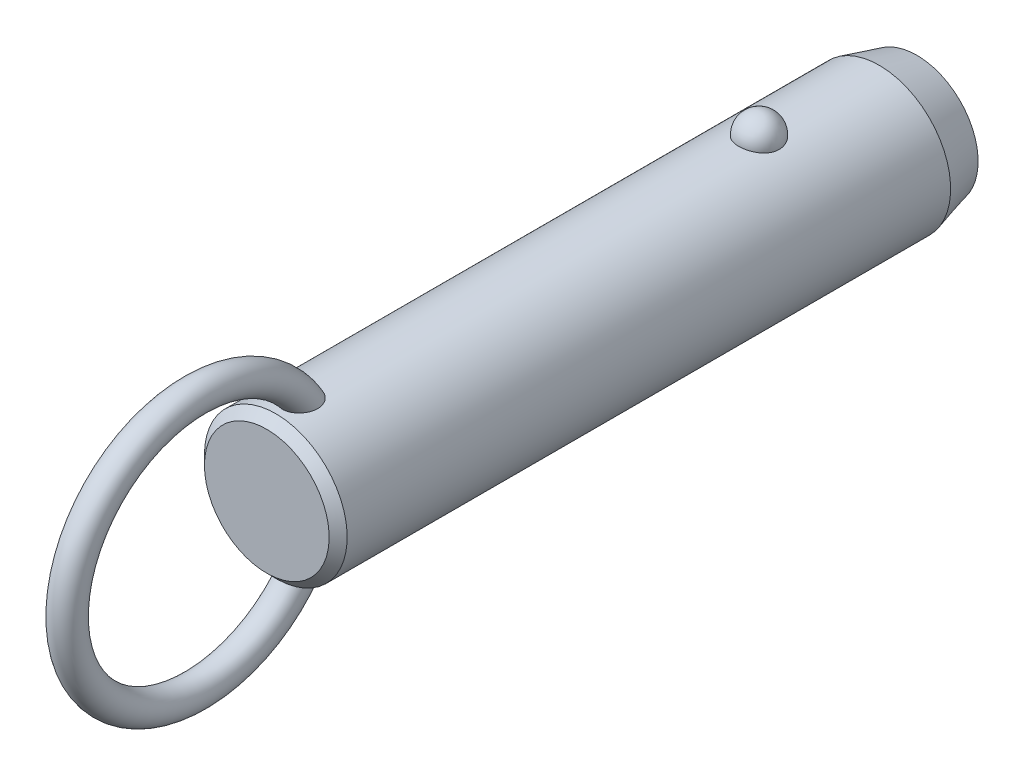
ISO-10303-21;
HEADER;
FILE_DESCRIPTION(('STEP AP214'),'2;1');
FILE_NAME('part.step','',(''),(''),'','','');
FILE_SCHEMA(('AUTOMOTIVE_DESIGN { 1 0 10303 214 1 1 1 1 }'));
ENDSEC;
DATA;
#1=APPLICATION_CONTEXT('core data for automotive mechanical design processes');
#2=APPLICATION_PROTOCOL_DEFINITION('international standard','automotive_design',2000,#1);
#3=PRODUCT_CONTEXT('',#1,'mechanical');
#4=PRODUCT('Part','Part','',(#3));
#5=PRODUCT_RELATED_PRODUCT_CATEGORY('part','',(#4));
#6=PRODUCT_DEFINITION_FORMATION('','',#4);
#7=PRODUCT_DEFINITION_CONTEXT('part definition',#1,'design');
#8=PRODUCT_DEFINITION('design','',#6,#7);
#9=PRODUCT_DEFINITION_SHAPE('','',#8);
#10=(LENGTH_UNIT() NAMED_UNIT(*) SI_UNIT(.MILLI.,.METRE.));
#11=(NAMED_UNIT(*) PLANE_ANGLE_UNIT() SI_UNIT($,.RADIAN.));
#12=(NAMED_UNIT(*) SI_UNIT($,.STERADIAN.) SOLID_ANGLE_UNIT());
#13=UNCERTAINTY_MEASURE_WITH_UNIT(LENGTH_MEASURE(1.E-05),#10,'distance_accuracy_value','');
#14=(GEOMETRIC_REPRESENTATION_CONTEXT(3) GLOBAL_UNCERTAINTY_ASSIGNED_CONTEXT((#13)) GLOBAL_UNIT_ASSIGNED_CONTEXT((#10,
#11,#12)) REPRESENTATION_CONTEXT('',''));
#15=CARTESIAN_POINT('',(0.,0.,0.));
#16=DIRECTION('',(0.,0.,1.));
#17=DIRECTION('',(1.,0.,0.));
#18=AXIS2_PLACEMENT_3D('',#15,#16,#17);
#19=CARTESIAN_POINT('',(0.,0.,53.3));
#20=DIRECTION('',(0.,0.,-1.));
#21=DIRECTION('',(-1.,0.,0.));
#22=AXIS2_PLACEMENT_3D('',#19,#20,#21);
#23=CYLINDRICAL_SURFACE('',#22,9.5);
#24=CARTESIAN_POINT('',(2.67259918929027,9.11631578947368,-2.70000000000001));
#25=CARTESIAN_POINT('',(2.6725968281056,9.11631786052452,-2.54909854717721));
#26=CARTESIAN_POINT('',(2.66030567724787,9.11994722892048,-2.39816735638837));
#27=CARTESIAN_POINT('',(2.6114347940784,9.13405924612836,-2.10058568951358));
#28=CARTESIAN_POINT('',(2.57484658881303,9.14454428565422,-1.95393672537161));
#29=CARTESIAN_POINT('',(2.47830875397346,9.17117631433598,-1.66916069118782));
#30=CARTESIAN_POINT('',(2.41836936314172,9.18732082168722,-1.53102991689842));
#31=CARTESIAN_POINT('',(2.27661331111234,9.22346780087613,-1.26705393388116));
#32=CARTESIAN_POINT('',(2.19479699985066,9.24347021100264,-1.14120852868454));
#33=CARTESIAN_POINT('',(2.01085282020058,9.28522401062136,-0.904632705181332));
#34=CARTESIAN_POINT('',(1.90862396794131,9.30698376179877,-0.793982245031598));
#35=CARTESIAN_POINT('',(1.6867437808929,9.34973971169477,-0.591607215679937));
#36=CARTESIAN_POINT('',(1.56709244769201,9.37073591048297,-0.499882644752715));
#37=CARTESIAN_POINT('',(1.31393976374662,9.40956370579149,-0.338167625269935));
#38=CARTESIAN_POINT('',(1.18048026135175,9.42740444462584,-0.268113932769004));
#39=CARTESIAN_POINT('',(0.903154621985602,9.45799906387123,-0.151390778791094));
#40=CARTESIAN_POINT('',(0.759289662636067,9.47075351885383,-0.104718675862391));
#41=CARTESIAN_POINT('',(0.468074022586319,9.48956256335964,-0.0367633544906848));
#42=CARTESIAN_POINT('',(0.320836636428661,9.49573643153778,-0.0150275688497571));
#43=CARTESIAN_POINT('',(0.0246714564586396,9.50112183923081,0.00396199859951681));
#44=CARTESIAN_POINT('',(-0.124256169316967,9.50033406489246,0.00121819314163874));
#45=CARTESIAN_POINT('',(-0.417264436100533,9.4919475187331,-0.0284441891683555));
#46=CARTESIAN_POINT('',(-0.561384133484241,9.48444885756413,-0.0550074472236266));
#47=CARTESIAN_POINT('',(-0.842986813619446,9.46357853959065,-0.131064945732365));
#48=CARTESIAN_POINT('',(-0.98046968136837,9.450206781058,-0.180559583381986));
#49=CARTESIAN_POINT('',(-1.24585005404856,9.41890822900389,-0.301476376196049));
#50=CARTESIAN_POINT('',(-1.37368611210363,9.40095498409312,-0.373026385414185));
#51=CARTESIAN_POINT('',(-1.61552738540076,9.3624296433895,-0.536025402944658));
#52=CARTESIAN_POINT('',(-1.72953116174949,9.34185727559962,-0.627476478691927));
#53=CARTESIAN_POINT('',(-1.9429225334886,9.29984568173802,-0.829844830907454));
#54=CARTESIAN_POINT('',(-2.04198021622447,9.27839736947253,-0.941108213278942));
#55=CARTESIAN_POINT('',(-2.2202646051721,9.23735994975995,-1.17883414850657));
#56=CARTESIAN_POINT('',(-2.29948985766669,9.21777097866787,-1.30529781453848));
#57=CARTESIAN_POINT('',(-2.43697287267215,9.18238994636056,-1.57158566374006));
#58=CARTESIAN_POINT('',(-2.49497068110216,9.16664569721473,-1.71155057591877));
#59=CARTESIAN_POINT('',(-2.5872073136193,9.14104303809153,-1.99961197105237));
#60=CARTESIAN_POINT('',(-2.62144683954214,9.13118445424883,-2.14770821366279));
#61=CARTESIAN_POINT('',(-2.66521466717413,9.11850622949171,-2.44715424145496));
#62=CARTESIAN_POINT('',(-2.67484831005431,9.11565658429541,-2.59848735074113));
#63=CARTESIAN_POINT('',(-2.66946735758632,9.11723375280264,-2.90067317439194));
#64=CARTESIAN_POINT('',(-2.65445345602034,9.12166036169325,-3.05152590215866));
#65=CARTESIAN_POINT('',(-2.6002971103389,9.13724422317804,-3.34766110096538));
#66=CARTESIAN_POINT('',(-2.56127978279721,9.14836656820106,-3.49296833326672));
#67=CARTESIAN_POINT('',(-2.46018844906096,9.17606676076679,-3.77477535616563));
#68=CARTESIAN_POINT('',(-2.39811349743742,9.19264483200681,-3.9112747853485));
#69=CARTESIAN_POINT('',(-2.25202303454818,9.22952198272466,-4.17244273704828));
#70=CARTESIAN_POINT('',(-2.16788714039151,9.24984129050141,-4.29704106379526));
#71=CARTESIAN_POINT('',(-1.9799408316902,9.29188255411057,-4.53013066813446));
#72=CARTESIAN_POINT('',(-1.87612963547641,9.31360456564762,-4.63862130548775));
#73=CARTESIAN_POINT('',(-1.65105429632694,9.35612959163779,-4.8369029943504));
#74=CARTESIAN_POINT('',(-1.52972405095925,9.37692871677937,-4.92661991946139));
#75=CARTESIAN_POINT('',(-1.27318250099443,9.41518970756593,-5.08429106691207));
#76=CARTESIAN_POINT('',(-1.13797219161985,9.432651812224,-5.15224684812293));
#77=CARTESIAN_POINT('',(-0.859280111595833,9.46208255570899,-5.26371827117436));
#78=CARTESIAN_POINT('',(-0.715925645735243,9.47411833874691,-5.30753421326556));
#79=CARTESIAN_POINT('',(-0.423550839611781,9.4916822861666,-5.37076321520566));
#80=CARTESIAN_POINT('',(-0.274531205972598,9.49721125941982,-5.39017930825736));
#81=CARTESIAN_POINT('',(0.0218446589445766,9.50110860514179,-5.40390587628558));
#82=CARTESIAN_POINT('',(0.169177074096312,9.49961381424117,-5.39869609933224));
#83=CARTESIAN_POINT('',(0.460808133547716,9.48993906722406,-5.36441955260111));
#84=CARTESIAN_POINT('',(0.605106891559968,9.48175936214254,-5.33535367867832));
#85=CARTESIAN_POINT('',(0.886027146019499,9.4596376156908,-5.25435587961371));
#86=CARTESIAN_POINT('',(1.02267710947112,9.44571881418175,-5.20251612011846));
#87=CARTESIAN_POINT('',(1.28523827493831,9.41358993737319,-5.07741549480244));
#88=CARTESIAN_POINT('',(1.41114877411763,9.39537958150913,-5.00415322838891));
#89=CARTESIAN_POINT('',(1.65085227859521,9.3562644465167,-4.83684599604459));
#90=CARTESIAN_POINT('',(1.76442346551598,9.33532178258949,-4.74249218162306));
#91=CARTESIAN_POINT('',(1.97425672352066,9.29321198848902,-4.53620389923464));
#92=CARTESIAN_POINT('',(2.07051582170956,9.27204482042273,-4.42426641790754));
#93=CARTESIAN_POINT('',(2.24490086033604,9.23139221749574,-4.18363183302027));
#94=CARTESIAN_POINT('',(2.32267019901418,9.21194380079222,-4.05466990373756));
#95=CARTESIAN_POINT('',(2.45584092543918,9.1773419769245,-3.78517836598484));
#96=CARTESIAN_POINT('',(2.51124979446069,9.16218713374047,-3.64465264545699));
#97=CARTESIAN_POINT('',(2.59380876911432,9.13913522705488,-3.37104301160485));
#98=CARTESIAN_POINT('',(2.62330266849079,9.13064624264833,-3.23871053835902));
#99=CARTESIAN_POINT('',(2.66269870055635,9.11923566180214,-2.9709266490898));
#100=CARTESIAN_POINT('',(2.67260130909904,9.11631393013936,-2.83547530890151));
#101=CARTESIAN_POINT('',(2.67259918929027,9.11631578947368,-2.70000000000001));
#102=B_SPLINE_CURVE_WITH_KNOTS('',3,(#24,#25,#26,#27,#28,#29,#30,#31,#32,#33,#34,#35,#36,#37,
#38,#39,#40,#41,#42,#43,#44,#45,#46,#47,#48,#49,#50,#51,#52,#53,#54,#55,#56,#57,#58,#59,#60,#61,
#62,#63,#64,#65,#66,#67,#68,#69,#70,#71,#72,#73,#74,#75,#76,#77,#78,#79,#80,#81,#82,#83,#84,#85,
#86,#87,#88,#89,#90,#91,#92,#93,#94,#95,#96,#97,#98,#99,#100,#101),.UNSPECIFIED.,.T.,.F.,(4,2,2,
2,2,2,2,2,2,2,2,2,2,2,2,2,2,2,2,2,2,2,2,2,2,2,2,2,2,2,2,2,2,2,2,2,2,2,4),(0.,0.452217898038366,
0.904593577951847,1.35677112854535,1.80894144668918,2.26340676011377,2.71787203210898,
3.17099820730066,3.62407318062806,4.0687883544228,4.51345969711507,4.95160616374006,
5.38976021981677,5.83050358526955,6.27129275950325,6.72071308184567,7.17016633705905,
7.62495278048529,8.07972578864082,8.53254856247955,8.98535859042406,9.43582813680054,
9.88631615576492,10.3393155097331,10.7923328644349,11.2471065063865,11.7018475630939,
12.1507959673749,12.5996885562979,13.0398725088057,13.4800399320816,13.9184421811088,
14.3568730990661,14.802202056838,15.2476074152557,15.7010097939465,16.1542603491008,
16.5602594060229,16.9662486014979),.UNSPECIFIED.);
#103=CARTESIAN_POINT('',(2.67259918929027,9.11631578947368,-2.70000000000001));
#104=VERTEX_POINT('',#103);
#105=EDGE_CURVE('E41',#104,#104,#102,.T.);
#106=ORIENTED_EDGE('',*,*,#105,.T.);
#107=EDGE_LOOP('',(#106));
#108=FACE_BOUND('',#107,.T.);
#109=CARTESIAN_POINT('',(0.,0.,61.62));
#110=DIRECTION('',(0.,0.,1.));
#111=DIRECTION('',(1.,0.,0.));
#112=AXIS2_PLACEMENT_3D('',#109,#110,#111);
#113=CIRCLE('',#112,9.5);
#114=CARTESIAN_POINT('',(-9.5,0.,61.62));
#115=VERTEX_POINT('',#114);
#116=EDGE_CURVE('E10',#115,#115,#113,.F.);
#117=ORIENTED_EDGE('',*,*,#116,.T.);
#118=EDGE_LOOP('',(#117));
#119=FACE_BOUND('',#118,.T.);
#120=CARTESIAN_POINT('',(-0.697062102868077,-9.47439269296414,55.9678088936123));
#121=CARTESIAN_POINT('',(-0.799579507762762,-9.46685146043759,56.0074823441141));
#122=CARTESIAN_POINT('',(-0.898575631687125,-9.45788043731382,56.0559309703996));
#123=CARTESIAN_POINT('',(-1.08670047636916,-9.43811593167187,56.1688685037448));
#124=CARTESIAN_POINT('',(-1.17583204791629,-9.42732297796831,56.233352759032));
#125=CARTESIAN_POINT('',(-1.34179806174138,-9.40513672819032,56.3762099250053));
#126=CARTESIAN_POINT('',(-1.41865133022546,-9.39374438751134,56.454561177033));
#127=CARTESIAN_POINT('',(-1.5586004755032,-9.37154196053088,56.6227524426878));
#128=CARTESIAN_POINT('',(-1.62169476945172,-9.3607319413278,56.7125937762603));
#129=CARTESIAN_POINT('',(-1.73527695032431,-9.34035749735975,56.9045001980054));
#130=CARTESIAN_POINT('',(-1.7852226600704,-9.33085270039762,57.0068910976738));
#131=CARTESIAN_POINT('',(-1.86924997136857,-9.3143834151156,57.218148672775));
#132=CARTESIAN_POINT('',(-1.90332570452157,-9.30741986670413,57.3270177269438));
#133=CARTESIAN_POINT('',(-1.95893603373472,-9.29588482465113,57.5604730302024));
#134=CARTESIAN_POINT('',(-1.97872420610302,-9.29165182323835,57.6854890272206));
#135=CARTESIAN_POINT('',(-2.00062129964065,-9.28695978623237,57.9370805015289));
#136=CARTESIAN_POINT('',(-2.00272284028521,-9.28650232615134,58.063656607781));
#137=CARTESIAN_POINT('',(-1.98958876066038,-9.28932750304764,58.3368157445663));
#138=CARTESIAN_POINT('',(-1.97143366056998,-9.2932400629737,58.4832519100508));
#139=CARTESIAN_POINT('',(-1.91479925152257,-9.30507151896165,58.7720629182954));
#140=CARTESIAN_POINT('',(-1.87629122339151,-9.31299607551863,58.914431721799));
#141=CARTESIAN_POINT('',(-1.77225683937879,-9.33340232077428,59.2151725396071));
#142=CARTESIAN_POINT('',(-1.70334898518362,-9.34641636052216,59.3723691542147));
#143=CARTESIAN_POINT('',(-1.58111062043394,-9.36759153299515,59.5975171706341));
#144=CARTESIAN_POINT('',(-1.53721459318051,-9.37492619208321,59.6707968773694));
#145=CARTESIAN_POINT('',(-1.44302631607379,-9.38988566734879,59.8130740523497));
#146=CARTESIAN_POINT('',(-1.39273721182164,-9.39751033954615,59.8820736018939));
#147=CARTESIAN_POINT('',(-1.26775962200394,-9.41530678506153,60.0369832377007));
#148=CARTESIAN_POINT('',(-1.19052326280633,-9.42548108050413,60.1208712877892));
#149=CARTESIAN_POINT('',(-1.02420241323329,-9.44499825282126,60.2760086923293));
#150=CARTESIAN_POINT('',(-0.935139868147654,-9.45434261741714,60.3472808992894));
#151=CARTESIAN_POINT('',(-0.766610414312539,-9.46930670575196,60.4586955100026));
#152=CARTESIAN_POINT('',(-0.689439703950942,-9.47529223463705,60.5022354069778));
#153=CARTESIAN_POINT('',(-0.528942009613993,-9.48560294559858,60.5763133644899));
#154=CARTESIAN_POINT('',(-0.44562029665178,-9.48992953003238,60.6068624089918));
#155=CARTESIAN_POINT('',(-0.273901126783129,-9.49644161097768,60.6525792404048));
#156=CARTESIAN_POINT('',(-0.185465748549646,-9.49860811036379,60.66761059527));
#157=CARTESIAN_POINT('',(-0.00734541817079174,-9.5004135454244,60.6801494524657));
#158=CARTESIAN_POINT('',(0.0823387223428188,-9.50005405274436,60.6776678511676));
#159=CARTESIAN_POINT('',(0.247679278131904,-9.49708301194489,60.6569959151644));
#160=CARTESIAN_POINT('',(0.323620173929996,-9.49477609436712,60.6409300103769));
#161=CARTESIAN_POINT('',(0.471981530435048,-9.48855917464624,60.5971726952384));
#162=CARTESIAN_POINT('',(0.54440029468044,-9.48464840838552,60.569475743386));
#163=CARTESIAN_POINT('',(0.708947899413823,-9.47398336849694,60.4928026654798));
#164=CARTESIAN_POINT('',(0.79914966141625,-9.46671310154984,60.4397745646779));
#165=CARTESIAN_POINT('',(0.969783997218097,-9.45076225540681,60.3199731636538));
#166=CARTESIAN_POINT('',(1.05019415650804,-9.44207854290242,60.2531692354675));
#167=CARTESIAN_POINT('',(1.23092343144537,-9.42051459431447,60.0807596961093));
#168=CARTESIAN_POINT('',(1.32652499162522,-9.40733378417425,59.9702619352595));
#169=CARTESIAN_POINT('',(1.49893121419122,-9.38140745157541,59.7355614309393));
#170=CARTESIAN_POINT('',(1.57571616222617,-9.36866239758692,59.6113445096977));
#171=CARTESIAN_POINT('',(1.71285426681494,-9.34457644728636,59.3493891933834));
#172=CARTESIAN_POINT('',(1.77266365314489,-9.33328726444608,59.2113623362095));
#173=CARTESIAN_POINT('',(1.87239208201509,-9.31379209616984,58.9280515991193));
#174=CARTESIAN_POINT('',(1.91230158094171,-9.3055875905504,58.782764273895));
#175=CARTESIAN_POINT('',(1.9760418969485,-9.29228394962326,58.4620281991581));
#176=CARTESIAN_POINT('',(1.99587438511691,-9.28797202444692,58.2857248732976));
#177=CARTESIAN_POINT('',(2.0029570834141,-9.28645519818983,57.9324146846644));
#178=CARTESIAN_POINT('',(1.99025930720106,-9.28923895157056,57.7554093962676));
#179=CARTESIAN_POINT('',(1.93735479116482,-9.30038134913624,57.4563381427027));
#180=CARTESIAN_POINT('',(1.90576827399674,-9.30697680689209,57.3326679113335));
#181=CARTESIAN_POINT('',(1.82287484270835,-9.32356855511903,57.0923297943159));
#182=CARTESIAN_POINT('',(1.77158213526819,-9.33356239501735,56.9756569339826));
#183=CARTESIAN_POINT('',(1.64885744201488,-9.35602275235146,56.7527061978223));
#184=CARTESIAN_POINT('',(1.57730995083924,-9.36850332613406,56.6464927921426));
#185=CARTESIAN_POINT('',(1.41543264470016,-9.39431873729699,56.4495530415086));
#186=CARTESIAN_POINT('',(1.32510883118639,-9.40765330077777,56.3588217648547));
#187=CARTESIAN_POINT('',(1.13846223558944,-9.43195720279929,56.2050334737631));
#188=CARTESIAN_POINT('',(1.04369890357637,-9.44302894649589,56.1400947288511));
#189=CARTESIAN_POINT('',(0.843965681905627,-9.46296805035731,56.0280388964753));
#190=CARTESIAN_POINT('',(0.739000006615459,-9.4718363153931,55.9809144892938));
#191=CARTESIAN_POINT('',(0.528175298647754,-9.48586140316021,55.9081173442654));
#192=CARTESIAN_POINT('',(0.422686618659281,-9.49119633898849,55.8814024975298));
#193=CARTESIAN_POINT('',(0.208590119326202,-9.49831365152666,55.8460137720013));
#194=CARTESIAN_POINT('',(0.0999817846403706,-9.500095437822,55.8373428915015));
#195=CARTESIAN_POINT('',(-0.126104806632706,-9.49988861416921,55.8383501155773));
#196=CARTESIAN_POINT('',(-0.243578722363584,-9.49757821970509,55.8495942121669));
#197=CARTESIAN_POINT('',(-0.474390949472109,-9.48885165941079,55.893167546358));
#198=CARTESIAN_POINT('',(-0.587729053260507,-9.48243528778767,55.9254978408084));
#199=CARTESIAN_POINT('',(-0.697062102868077,-9.47439269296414,55.9678088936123));
#200=B_SPLINE_CURVE_WITH_KNOTS('',3,(#120,#121,#122,#123,#124,#125,#126,#127,#128,#129,#130,
#131,#132,#133,#134,#135,#136,#137,#138,#139,#140,#141,#142,#143,#144,#145,#146,#147,#148,#149,
#150,#151,#152,#153,#154,#155,#156,#157,#158,#159,#160,#161,#162,#163,#164,#165,#166,#167,#168,
#169,#170,#171,#172,#173,#174,#175,#176,#177,#178,#179,#180,#181,#182,#183,#184,#185,#186,#187,
#188,#189,#190,#191,#192,#193,#194,#195,#196,#197,#198,#199),.UNSPECIFIED.,.T.,.F.,(4,2,2,2,2,2,
2,2,2,2,2,2,2,2,2,2,2,2,2,2,2,2,2,2,2,2,2,2,2,2,2,2,2,2,2,2,2,2,2,4),(0.,0.330119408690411,
0.660143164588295,0.989655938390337,1.31920659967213,1.66074728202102,2.00241415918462,
2.38088696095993,2.75951768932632,3.20065679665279,3.6424200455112,4.15620996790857,
4.41314162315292,4.66994734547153,5.01228664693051,5.35399933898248,5.61943037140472,
5.88463652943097,6.15215502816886,6.41950709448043,6.65144391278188,6.88349136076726,
7.19641200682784,7.51003602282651,7.94779711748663,8.38601491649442,8.83699707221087,
9.28819530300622,9.81778662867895,10.3465317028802,10.7284172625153,11.1100280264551,
11.4938603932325,11.8775702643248,12.2220189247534,12.5663259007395,12.8915939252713,
13.2169159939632,13.5689650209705,13.9210316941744),.UNSPECIFIED.);
#201=CARTESIAN_POINT('',(-0.697062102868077,-9.47439269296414,55.9678088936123));
#202=VERTEX_POINT('',#201);
#203=EDGE_CURVE('E59',#202,#202,#200,.T.);
#204=ORIENTED_EDGE('',*,*,#203,.T.);
#205=EDGE_LOOP('',(#204));
#206=FACE_BOUND('',#205,.T.);
#207=CARTESIAN_POINT('',(-0.697062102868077,9.47439269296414,55.9678088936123));
#208=CARTESIAN_POINT('',(-0.597792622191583,9.48169483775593,55.9293956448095));
#209=CARTESIAN_POINT('',(-0.495106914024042,9.48766580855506,55.8991682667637));
#210=CARTESIAN_POINT('',(-0.285876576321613,9.49627648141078,55.8560327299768));
#211=CARTESIAN_POINT('',(-0.179324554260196,9.49890941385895,55.8431597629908));
#212=CARTESIAN_POINT('',(0.0344157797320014,9.50053798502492,55.8351666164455));
#213=CARTESIAN_POINT('',(0.141603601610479,9.49953613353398,55.8400341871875));
#214=CARTESIAN_POINT('',(0.353563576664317,9.49401038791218,55.8673654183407));
#215=CARTESIAN_POINT('',(0.458336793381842,9.48948807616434,55.88982117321));
#216=CARTESIAN_POINT('',(0.662493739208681,9.4774236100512,55.9516719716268));
#217=CARTESIAN_POINT('',(0.761881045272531,9.46988348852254,55.9910556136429));
#218=CARTESIAN_POINT('',(0.952608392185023,9.45260382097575,56.0856342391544));
#219=CARTESIAN_POINT('',(1.04394806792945,9.44286417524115,56.1408299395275));
#220=CARTESIAN_POINT('',(1.21712767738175,9.4221176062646,56.2660662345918));
#221=CARTESIAN_POINT('',(1.29885671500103,9.41109835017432,56.3362579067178));
#222=CARTESIAN_POINT('',(1.4497897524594,9.38903310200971,56.4889801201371));
#223=CARTESIAN_POINT('',(1.51899278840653,9.37798710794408,56.5715116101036));
#224=CARTESIAN_POINT('',(1.64602857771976,9.35654375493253,56.7497763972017));
#225=CARTESIAN_POINT('',(1.70333052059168,9.34618688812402,56.8458916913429));
#226=CARTESIAN_POINT('',(1.80259341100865,9.32755128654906,57.045897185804));
#227=CARTESIAN_POINT('',(1.84454942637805,9.31927322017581,57.1497898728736));
#228=CARTESIAN_POINT('',(1.91637039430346,9.30478365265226,57.3722131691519));
#229=CARTESIAN_POINT('',(1.944805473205,9.29882552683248,57.4912192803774));
#230=CARTESIAN_POINT('',(1.98449865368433,9.29043398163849,57.7321436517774));
#231=CARTESIAN_POINT('',(1.99574908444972,9.28800213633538,57.8540631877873));
#232=CARTESIAN_POINT('',(2.00275141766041,9.28649645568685,58.1169324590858));
#233=CARTESIAN_POINT('',(1.99588238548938,9.28799035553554,58.2579529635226));
#234=CARTESIAN_POINT('',(1.96270559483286,9.29505517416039,58.5376217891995));
#235=CARTESIAN_POINT('',(1.93637872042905,9.30063010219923,58.676267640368));
#236=CARTESIAN_POINT('',(1.85949176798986,9.31633564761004,58.9725616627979));
#237=CARTESIAN_POINT('',(1.80549792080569,9.3270926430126,59.1292907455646));
#238=CARTESIAN_POINT('',(1.67376869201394,9.3516306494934,59.4322840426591));
#239=CARTESIAN_POINT('',(1.59603181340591,9.36541185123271,59.5785475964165));
#240=CARTESIAN_POINT('',(1.4360277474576,9.39110706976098,59.8258138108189));
#241=CARTESIAN_POINT('',(1.35831795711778,9.40278656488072,59.929791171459));
#242=CARTESIAN_POINT('',(1.18774483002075,9.42585025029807,60.1245347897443));
#243=CARTESIAN_POINT('',(1.09490932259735,9.43723493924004,60.2153247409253));
#244=CARTESIAN_POINT('',(0.921110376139,9.45552616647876,60.3562033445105));
#245=CARTESIAN_POINT('',(0.843738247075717,9.46281058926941,60.4106563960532));
#246=CARTESIAN_POINT('',(0.681245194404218,9.47589120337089,60.5067117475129));
#247=CARTESIAN_POINT('',(0.596135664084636,9.48168953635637,60.5483325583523));
#248=CARTESIAN_POINT('',(0.433779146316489,9.49038144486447,60.6100899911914));
#249=CARTESIAN_POINT('',(0.357459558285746,9.49359170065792,60.6326013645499));
#250=CARTESIAN_POINT('',(0.20207411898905,9.49816761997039,60.6645745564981));
#251=CARTESIAN_POINT('',(0.12301025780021,9.49953459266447,60.6740456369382));
#252=CARTESIAN_POINT('',(-0.0357372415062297,9.50026497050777,60.6791143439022));
#253=CARTESIAN_POINT('',(-0.115421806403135,9.49962433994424,60.6746840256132));
#254=CARTESIAN_POINT('',(-0.272823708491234,9.49640854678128,60.6522962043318));
#255=CARTESIAN_POINT('',(-0.350540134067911,9.4938325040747,60.6343325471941));
#256=CARTESIAN_POINT('',(-0.500580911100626,9.4870946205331,60.5868028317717));
#257=CARTESIAN_POINT('',(-0.572979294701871,9.48296359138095,60.5574618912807));
#258=CARTESIAN_POINT('',(-0.712864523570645,9.47347609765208,60.4890087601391));
#259=CARTESIAN_POINT('',(-0.7803490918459,9.46811906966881,60.4498920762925));
#260=CARTESIAN_POINT('',(-0.946309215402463,9.45329720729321,60.339432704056));
#261=CARTESIAN_POINT('',(-1.04090230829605,9.44321512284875,60.2623297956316));
#262=CARTESIAN_POINT('',(-1.21661929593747,9.42219227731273,60.0940971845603));
#263=CARTESIAN_POINT('',(-1.29770519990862,9.41124921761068,60.0029292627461));
#264=CARTESIAN_POINT('',(-1.4731964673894,9.38563439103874,59.7761621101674));
#265=CARTESIAN_POINT('',(-1.56208878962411,9.37102009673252,59.6362895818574));
#266=CARTESIAN_POINT('',(-1.71623987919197,9.34401559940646,59.3439503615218));
#267=CARTESIAN_POINT('',(-1.7814786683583,9.33162728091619,59.1914731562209));
#268=CARTESIAN_POINT('',(-1.88853837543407,9.31055541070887,58.8756470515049));
#269=CARTESIAN_POINT('',(-1.9299899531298,9.30193076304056,58.7121685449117));
#270=CARTESIAN_POINT('',(-1.98590726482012,9.29015757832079,58.3805268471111));
#271=CARTESIAN_POINT('',(-2.00040705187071,9.2870021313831,58.2123698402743));
#272=CARTESIAN_POINT('',(-1.99964701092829,9.28716218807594,57.9050806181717));
#273=CARTESIAN_POINT('',(-1.98908145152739,9.28945704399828,57.7659362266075));
#274=CARTESIAN_POINT('',(-1.94566294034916,9.29865169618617,57.4911539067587));
#275=CARTESIAN_POINT('',(-1.91282062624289,9.30554929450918,57.355514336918));
#276=CARTESIAN_POINT('',(-1.84582133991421,9.31898248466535,57.1578026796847));
#277=CARTESIAN_POINT('',(-1.82038084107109,9.32400364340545,57.0925830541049));
#278=CARTESIAN_POINT('',(-1.76350511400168,9.33492884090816,56.9649033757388));
#279=CARTESIAN_POINT('',(-1.73207305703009,9.3408324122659,56.9024418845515));
#280=CARTESIAN_POINT('',(-1.66324243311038,9.353333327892,56.7809407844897));
#281=CARTESIAN_POINT('',(-1.62584239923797,9.35993084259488,56.7219020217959));
#282=CARTESIAN_POINT('',(-1.545276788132,9.37356864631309,56.6079875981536));
#283=CARTESIAN_POINT('',(-1.50211241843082,9.38060884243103,56.5531110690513));
#284=CARTESIAN_POINT('',(-1.37681147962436,9.40004442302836,56.4099619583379));
#285=CARTESIAN_POINT('',(-1.28916358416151,9.41261047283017,56.3264295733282));
#286=CARTESIAN_POINT('',(-1.09996826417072,9.43658180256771,56.1772360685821));
#287=CARTESIAN_POINT('',(-0.998461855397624,9.44799034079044,56.1115238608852));
#288=CARTESIAN_POINT('',(-0.8601889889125,9.46103017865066,56.0394367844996));
#289=CARTESIAN_POINT('',(-0.828141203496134,9.46389141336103,56.0238511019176));
#290=CARTESIAN_POINT('',(-0.763210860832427,9.46934915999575,55.9944734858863));
#291=CARTESIAN_POINT('',(-0.73032830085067,9.47194567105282,55.9806815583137));
#292=CARTESIAN_POINT('',(-0.697062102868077,9.47439269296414,55.9678088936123));
#293=B_SPLINE_CURVE_WITH_KNOTS('',3,(#207,#208,#209,#210,#211,#212,#213,#214,#215,#216,#217,
#218,#219,#220,#221,#222,#223,#224,#225,#226,#227,#228,#229,#230,#231,#232,#233,#234,#235,#236,
#237,#238,#239,#240,#241,#242,#243,#244,#245,#246,#247,#248,#249,#250,#251,#252,#253,#254,#255,
#256,#257,#258,#259,#260,#261,#262,#263,#264,#265,#266,#267,#268,#269,#270,#271,#272,#273,#274,
#275,#276,#277,#278,#279,#280,#281,#282,#283,#284,#285,#286,#287,#288,#289,#290,#291,#292),
.UNSPECIFIED.,.T.,.F.,(4,2,2,2,2,2,2,2,2,2,2,2,2,2,2,2,2,2,2,2,2,2,2,2,2,2,2,2,2,2,2,2,2,2,2,2,
2,2,2,2,2,2,4),(0.,0.319942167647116,0.640532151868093,0.96090081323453,1.28112555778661,
1.60113495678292,1.92115886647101,2.24457323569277,2.56801248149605,2.90371927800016,
3.23953387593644,3.60560313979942,3.97183576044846,4.39383693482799,4.81625324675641,
5.31257045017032,5.80891895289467,6.19868344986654,6.58773876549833,6.87145417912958,
7.15475838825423,7.3926375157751,7.63034760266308,7.86853584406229,8.10683246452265,
8.3406366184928,8.57454843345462,8.93983939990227,9.30614105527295,9.80266668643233,
10.2996107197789,10.8040753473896,11.3079021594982,11.7249776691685,12.1418541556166,
12.3521485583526,12.562331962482,12.7725671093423,12.9827582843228,13.3458276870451,
13.7078449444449,13.8150604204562,13.9222762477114),.UNSPECIFIED.);
#294=CARTESIAN_POINT('',(-0.697062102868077,9.47439269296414,55.9678088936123));
#295=VERTEX_POINT('',#294);
#296=EDGE_CURVE('E67',#295,#295,#293,.T.);
#297=ORIENTED_EDGE('',*,*,#296,.T.);
#298=EDGE_LOOP('',(#297));
#299=FACE_BOUND('',#298,.T.);
#300=CARTESIAN_POINT('',(0.,0.,-18.6999999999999));
#301=DIRECTION('',(0.,0.,-1.));
#302=DIRECTION('',(-1.,0.,0.));
#303=AXIS2_PLACEMENT_3D('',#300,#301,#302);
#304=CIRCLE('',#303,9.5);
#305=CARTESIAN_POINT('',(-9.5,0.,-18.6999999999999));
#306=VERTEX_POINT('',#305);
#307=EDGE_CURVE('E56',#306,#306,#304,.F.);
#308=ORIENTED_EDGE('',*,*,#307,.T.);
#309=EDGE_LOOP('',(#308));
#310=FACE_BOUND('',#309,.T.);
#311=ADVANCED_FACE('F37',(#108,#119,#206,#299,#310),#23,.T.);
#312=CARTESIAN_POINT('',(0.,0.,-23.7));
#313=DIRECTION('',(0.,0.,-1.));
#314=DIRECTION('',(-1.,0.,0.));
#315=AXIS2_PLACEMENT_3D('',#312,#313,#314);
#316=PLANE('',#315);
#317=CARTESIAN_POINT('',(0.,0.,-23.7));
#318=DIRECTION('',(0.,0.,-1.));
#319=DIRECTION('',(-1.,0.,0.));
#320=AXIS2_PLACEMENT_3D('',#317,#318,#319);
#321=CIRCLE('',#320,8.16025403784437);
#322=CARTESIAN_POINT('',(-8.16025403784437,0.,-23.7));
#323=VERTEX_POINT('',#322);
#324=EDGE_CURVE('E66',#323,#323,#321,.T.);
#325=ORIENTED_EDGE('',*,*,#324,.T.);
#326=EDGE_LOOP('',(#325));
#327=FACE_BOUND('',#326,.T.);
#328=ADVANCED_FACE('F85',(#327),#316,.T.);
#329=CARTESIAN_POINT('',(0.,0.,-23.7));
#330=DIRECTION('',(0.,0.,1.));
#331=DIRECTION('',(1.,0.,0.));
#332=AXIS2_PLACEMENT_3D('',#329,#330,#331);
#333=CONICAL_SURFACE('',#332,8.16025403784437,0.261799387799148);
#334=ORIENTED_EDGE('',*,*,#307,.F.);
#335=EDGE_LOOP('',(#334));
#336=FACE_BOUND('',#335,.T.);
#337=ORIENTED_EDGE('',*,*,#324,.F.);
#338=EDGE_LOOP('',(#337));
#339=FACE_BOUND('',#338,.T.);
#340=ADVANCED_FACE('F83',(#336,#339),#333,.T.);
#341=CARTESIAN_POINT('',(0.,0.,62.82));
#342=DIRECTION('',(0.,0.,1.));
#343=DIRECTION('',(1.,0.,0.));
#344=AXIS2_PLACEMENT_3D('',#341,#342,#343);
#345=PLANE('',#344);
#346=CARTESIAN_POINT('',(0.,0.,62.82));
#347=DIRECTION('',(0.,0.,1.));
#348=DIRECTION('',(1.,0.,0.));
#349=AXIS2_PLACEMENT_3D('',#346,#347,#348);
#350=CIRCLE('',#349,8.29999999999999);
#351=CARTESIAN_POINT('',(-8.3,0.,62.82));
#352=VERTEX_POINT('',#351);
#353=EDGE_CURVE('E50',#352,#352,#350,.T.);
#354=ORIENTED_EDGE('',*,*,#353,.T.);
#355=EDGE_LOOP('',(#354));
#356=FACE_BOUND('',#355,.T.);
#357=ADVANCED_FACE('F77',(#356),#345,.T.);
#358=CARTESIAN_POINT('',(0.,0.,72.35));
#359=DIRECTION('',(1.,0.,0.));
#360=DIRECTION('',(0.,0.,-1.));
#361=AXIS2_PLACEMENT_3D('',#358,#359,#360);
#362=TOROIDAL_SURFACE('',#361,17.05,2.);
#363=ORIENTED_EDGE('',*,*,#296,.F.);
#364=EDGE_LOOP('',(#363));
#365=FACE_BOUND('',#364,.T.);
#366=ORIENTED_EDGE('',*,*,#203,.F.);
#367=EDGE_LOOP('',(#366));
#368=FACE_BOUND('',#367,.T.);
#369=ADVANCED_FACE('F73',(#365,#368),#362,.T.);
#370=CARTESIAN_POINT('',(0.,0.,62.82));
#371=DIRECTION('',(0.,0.,-1.));
#372=DIRECTION('',(-1.,0.,0.));
#373=AXIS2_PLACEMENT_3D('',#370,#371,#372);
#374=CONICAL_SURFACE('',#373,8.29999999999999,0.785398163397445);
#375=CARTESIAN_POINT('',(-9.5,0.,61.62));
#376=CARTESIAN_POINT('',(-9.4875,0.,61.6325));
#377=CARTESIAN_POINT('',(-9.475,0.,61.645));
#378=CARTESIAN_POINT('',(-9.45,0.,61.67));
#379=CARTESIAN_POINT('',(-9.4375,0.,61.6825));
#380=CARTESIAN_POINT('',(-9.4125,0.,61.7075));
#381=CARTESIAN_POINT('',(-9.4,0.,61.72));
#382=CARTESIAN_POINT('',(-9.375,0.,61.745));
#383=CARTESIAN_POINT('',(-9.3625,0.,61.7575));
#384=CARTESIAN_POINT('',(-9.3375,0.,61.7825));
#385=CARTESIAN_POINT('',(-9.325,0.,61.795));
#386=CARTESIAN_POINT('',(-9.3,0.,61.82));
#387=CARTESIAN_POINT('',(-9.2875,0.,61.8325));
#388=CARTESIAN_POINT('',(-9.2625,0.,61.8575));
#389=CARTESIAN_POINT('',(-9.25,0.,61.87));
#390=CARTESIAN_POINT('',(-9.225,0.,61.895));
#391=CARTESIAN_POINT('',(-9.2125,0.,61.9075));
#392=CARTESIAN_POINT('',(-9.1875,0.,61.9325));
#393=CARTESIAN_POINT('',(-9.175,0.,61.945));
#394=CARTESIAN_POINT('',(-9.15,0.,61.97));
#395=CARTESIAN_POINT('',(-9.1375,0.,61.9825));
#396=CARTESIAN_POINT('',(-9.1125,0.,62.0075));
#397=CARTESIAN_POINT('',(-9.1,0.,62.02));
#398=CARTESIAN_POINT('',(-9.075,0.,62.045));
#399=CARTESIAN_POINT('',(-9.0625,0.,62.0575));
#400=CARTESIAN_POINT('',(-9.0375,0.,62.0825));
#401=CARTESIAN_POINT('',(-9.025,0.,62.095));
#402=CARTESIAN_POINT('',(-9.,0.,62.12));
#403=CARTESIAN_POINT('',(-8.9875,0.,62.1325));
#404=CARTESIAN_POINT('',(-8.9625,0.,62.1575));
#405=CARTESIAN_POINT('',(-8.95,0.,62.17));
#406=CARTESIAN_POINT('',(-8.925,0.,62.195));
#407=CARTESIAN_POINT('',(-8.9125,0.,62.2075));
#408=CARTESIAN_POINT('',(-8.8875,0.,62.2325));
#409=CARTESIAN_POINT('',(-8.875,0.,62.245));
#410=CARTESIAN_POINT('',(-8.85,0.,62.27));
#411=CARTESIAN_POINT('',(-8.8375,0.,62.2825));
#412=CARTESIAN_POINT('',(-8.8125,0.,62.3075));
#413=CARTESIAN_POINT('',(-8.8,0.,62.32));
#414=CARTESIAN_POINT('',(-8.775,0.,62.345));
#415=CARTESIAN_POINT('',(-8.7625,0.,62.3575));
#416=CARTESIAN_POINT('',(-8.7375,0.,62.3825));
#417=CARTESIAN_POINT('',(-8.725,0.,62.395));
#418=CARTESIAN_POINT('',(-8.7,0.,62.42));
#419=CARTESIAN_POINT('',(-8.6875,0.,62.4325));
#420=CARTESIAN_POINT('',(-8.6625,0.,62.4575));
#421=CARTESIAN_POINT('',(-8.65,0.,62.47));
#422=CARTESIAN_POINT('',(-8.625,0.,62.495));
#423=CARTESIAN_POINT('',(-8.6125,0.,62.5075));
#424=CARTESIAN_POINT('',(-8.5875,0.,62.5325));
#425=CARTESIAN_POINT('',(-8.575,0.,62.545));
#426=CARTESIAN_POINT('',(-8.55,0.,62.57));
#427=CARTESIAN_POINT('',(-8.53749999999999,0.,62.5825));
#428=CARTESIAN_POINT('',(-8.5125,0.,62.6075));
#429=CARTESIAN_POINT('',(-8.5,0.,62.62));
#430=CARTESIAN_POINT('',(-8.475,0.,62.645));
#431=CARTESIAN_POINT('',(-8.4625,0.,62.6575));
#432=CARTESIAN_POINT('',(-8.43749999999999,0.,62.6825));
#433=CARTESIAN_POINT('',(-8.425,0.,62.695));
#434=CARTESIAN_POINT('',(-8.4,0.,62.72));
#435=CARTESIAN_POINT('',(-8.3875,0.,62.7325));
#436=CARTESIAN_POINT('',(-8.3625,0.,62.7575));
#437=CARTESIAN_POINT('',(-8.35,0.,62.77));
#438=CARTESIAN_POINT('',(-8.32499999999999,0.,62.795));
#439=CARTESIAN_POINT('',(-8.31249999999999,0.,62.8075));
#440=CARTESIAN_POINT('',(-8.3,0.,62.82));
#441=B_SPLINE_CURVE_WITH_KNOTS('',3,(#375,#376,#377,#378,#379,#380,#381,#382,#383,#384,#385,
#386,#387,#388,#389,#390,#391,#392,#393,#394,#395,#396,#397,#398,#399,#400,#401,#402,#403,#404,
#405,#406,#407,#408,#409,#410,#411,#412,#413,#414,#415,#416,#417,#418,#419,#420,#421,#422,#423,
#424,#425,#426,#427,#428,#429,#430,#431,#432,#433,#434,#435,#436,#437,#438,#439,#440),
.UNSPECIFIED.,.F.,.F.,(4,2,2,2,2,2,2,2,2,2,2,2,2,2,2,2,2,2,2,2,2,2,2,2,2,2,2,2,2,2,2,2,4),(0.,
0.0530330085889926,0.106066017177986,0.159099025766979,0.212132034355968,0.265165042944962,
0.318198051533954,0.371231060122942,0.424264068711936,0.47729707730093,0.530330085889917,
0.583363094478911,0.636396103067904,0.689429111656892,0.742462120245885,0.795495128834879,
0.848528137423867,0.90156114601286,0.954594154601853,1.00762716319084,1.06066017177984,
1.11369318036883,1.16672618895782,1.21975919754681,1.2727922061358,1.32582521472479,
1.37885822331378,1.43189123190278,1.48492424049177,1.53795724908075,1.59099025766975,
1.64402326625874,1.69705627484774),.UNSPECIFIED.);
#442=EDGE_CURVE('BSEAM39',#115,#352,#441,.T.);
#443=ORIENTED_EDGE('',*,*,#116,.F.);
#444=ORIENTED_EDGE('',*,*,#353,.F.);
#445=ORIENTED_EDGE('',*,*,#442,.T.);
#446=ORIENTED_EDGE('',*,*,#442,.F.);
#447=EDGE_LOOP('',(#443,#445,#444,#446));
#448=FACE_BOUND('',#447,.T.);
#449=ADVANCED_FACE('F39',(#448),#374,.T.);
#450=CARTESIAN_POINT('',(0.,9.5,-2.70000000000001));
#451=DIRECTION('',(0.,1.,0.));
#452=DIRECTION('',(0.,0.,-1.));
#453=AXIS2_PLACEMENT_3D('',#450,#451,#452);
#454=SPHERICAL_SURFACE('',#453,2.7);
#455=ORIENTED_EDGE('',*,*,#105,.F.);
#456=EDGE_LOOP('',(#455));
#457=FACE_BOUND('',#456,.T.);
#458=ADVANCED_FACE('F79',(#457),#454,.T.);
#459=CLOSED_SHELL('',(#311,#328,#340,#357,#369,#449,#458));
#460=MANIFOLD_SOLID_BREP('B2',#459);
#461=ADVANCED_BREP_SHAPE_REPRESENTATION('',(#18,#460),#14);
#462=SHAPE_DEFINITION_REPRESENTATION(#9,#461);
ENDSEC;
END-ISO-10303-21;
